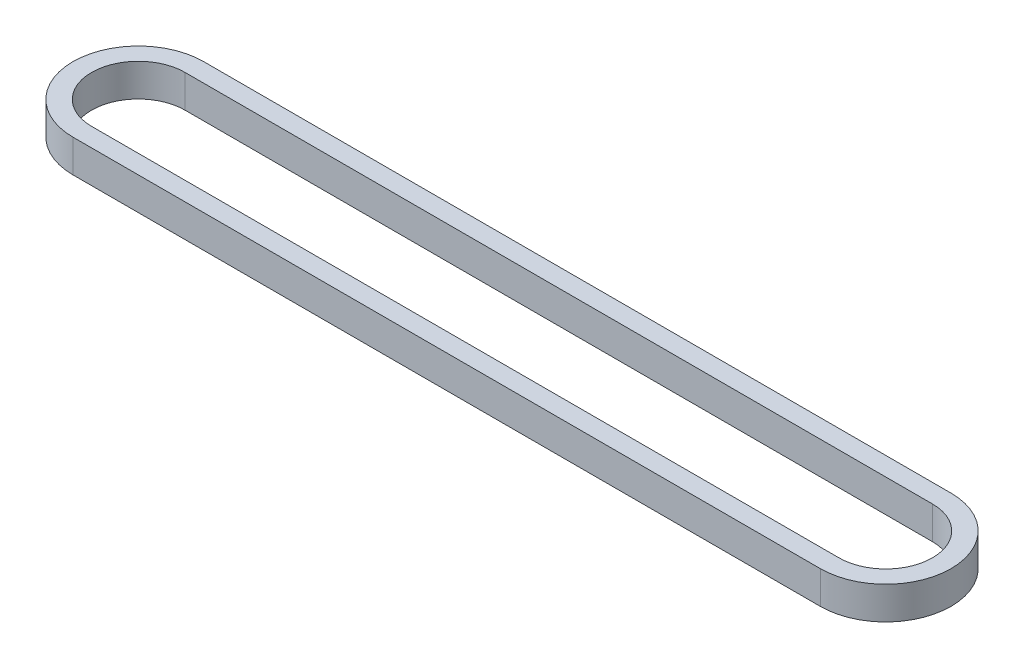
from build123d import *

# Parameters (mm, degrees)
BOSS_EXTRUDE1_DEPTH = 3.5


with BuildPart() as part:
    # Sketch1 → Boss-Extrude1 (new body)
    with BuildSketch(Plane(origin=(0, 0, 0), x_dir=(1, 0, 0), z_dir=(0, 1, 0))):
        with BuildLine():
            Line((0, -7), (-80.01, -7))
            ThreePointArc((-80.01, -7), (-87.01, 0), (-80.01, 7))
            Line((-80.01, 7), (0, 7))
            ThreePointArc((0, 7), (7, 0), (0, -7))
        make_face()
        with BuildLine():
            Line((0, -5), (-80.01, -5))
            ThreePointArc((-80.01, -5), (-85.01, 0), (-80.01, 5))
            Line((-80.01, 5), (0, 5))
            ThreePointArc((0, 5), (5, 0), (0, -5))
        make_face(mode=Mode.SUBTRACT)
    extrude(amount=BOSS_EXTRUDE1_DEPTH)


solid = part.part
